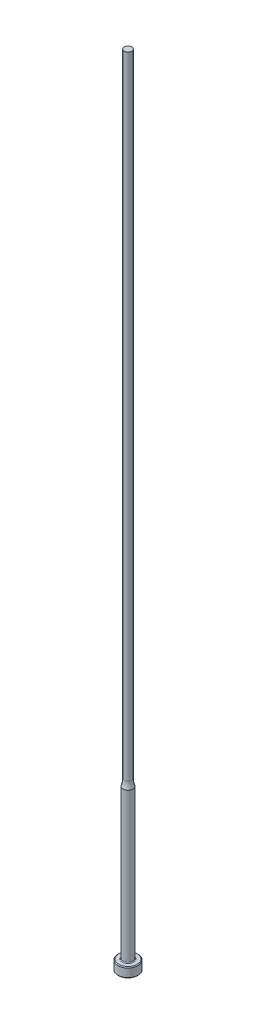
from build123d import *

# Parameters (mm, degrees)
CHAMFER1_SIZE = 0.254
FILLET1_R     = 0.254


with BuildPart() as part:
    # Sketch1 → Revolve1 (revolve)
    with BuildSketch(Plane.XY, mode=Mode.PRIVATE) as revolve1_sk:
        with BuildLine():
            Line((0, 0), (-3.175, 0))
            Line((-3.175, 0), (-3.175, 3.175))
            Line((-3.175, 3.175), (-1.5875, 3.175))
            Line((-1.5875, 3.175), (-1.5875, 50.8))
            ThreePointArc((-1.5875, 50.8), (-1.290157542, 51.887986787), (-1.18999, 53.011416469))
            Line((-1.18999, 53.011416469), (-1.18999, 254))
            Line((-1.18999, 254), (0, 254))
            Line((0, 254), (0, 0))
        make_face()
    revolve(revolve1_sk.sketch.rotate(Axis((0, 259.958771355, 0), (0, -1, 0)), 270), axis=Axis((0, 259.958771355, 0), (0, -1, 0)))

    # Chamfer1
    chamfer1_edges = [part.edges().sort_by_distance(p)[0] for p in [
        (0, 0, -3.175),
        (0, 3.175, -3.175),
    ]]
    chamfer(chamfer1_edges, length=CHAMFER1_SIZE)

    # Fillet1
    fillet1_edges = [part.edges().sort_by_distance(p)[0] for p in [
        (0, 3.175, -1.5875),
    ]]
    fillet(fillet1_edges, radius=FILLET1_R)


solid = part.part
